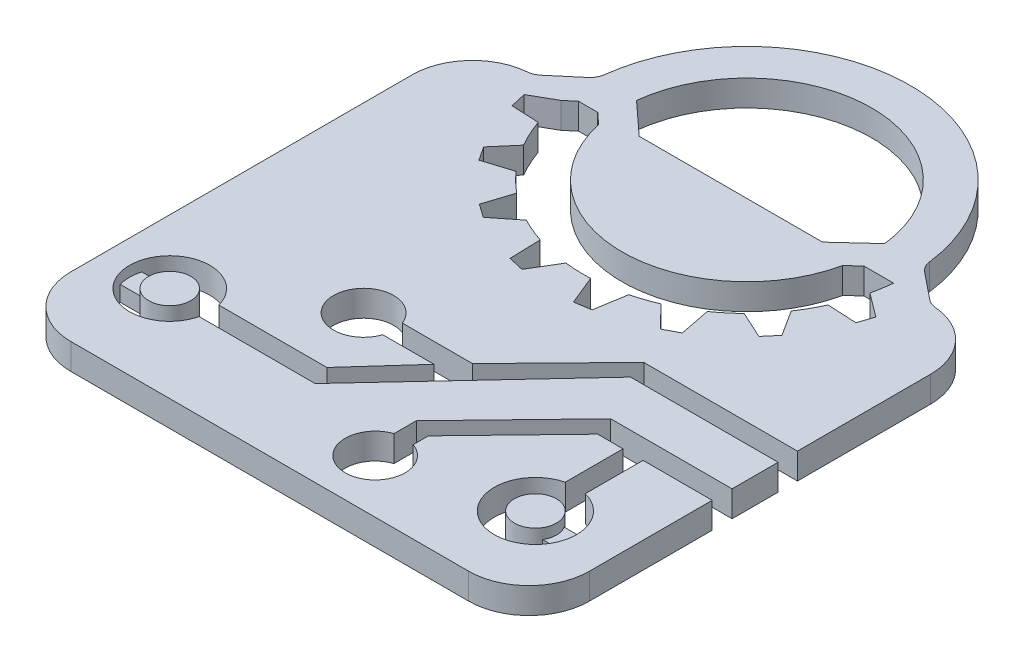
from build123d import *

# Parameters (mm, degrees)
BOSS_EXTRUDE1_DEPTH   = 60.24
SKETCH1_R             = 48.868731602
BOSS_EXTRUDE1_2_DEPTH = 60.24
BOSS_EXTRUDE1_3_DEPTH = 60.24
BOSS_EXTRUDE3_DEPTH   = 36.14
SCALE2_SCALE          = 0.083


with BuildPart() as part:
    # Sketch1 → Boss-Extrude1 (new body)
    with BuildSketch(Plane(origin=(0, 0, 0), x_dir=(1, 0, 0), z_dir=(0, 1, 0))):
        with BuildLine():
            Line((245.136811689, -121.5896186), (601.855675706, -121.5896186))
            Line((601.855675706, -121.5896186), (601.855675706, 187.682234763))
            ThreePointArc((601.855675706, 187.682234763), (564.86409315, 282.493974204), (473.43759091, 327.202338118))
            ThreePointArc((473.43759091, 327.202338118), (461.876494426, 329.931995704), (451.626857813, 335.936571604))
            Line((451.626857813, 335.936571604), (389.269284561, 386.257187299))
            ThreePointArc((389.269284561, 386.257187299), (379.451035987, 397.909466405), (374.702603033, 412.387933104))
            ThreePointArc((374.702603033, 412.387933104), (-2.245902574, 744.620020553), (-378.751905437, 411.886545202))
            ThreePointArc((-378.751905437, 411.886545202), (-383.268389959, 397.789512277), (-392.602428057, 386.300356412))
            Line((-392.602428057, 386.300356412), (-451.452798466, 336.487556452))
            ThreePointArc((-451.452798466, 336.487556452), (-461.934475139, 330.085900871), (-473.864370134, 327.166252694))
            ThreePointArc((-473.864370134, 327.166252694), (-565.00900144, 282.33629643), (-601.855675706, 187.682234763))
            Line((-601.855675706, 187.682234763), (-601.855675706, -604.620104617))
            ThreePointArc((-601.855675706, -604.620104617), (-560.850625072, -703.615053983), (-461.855675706, -744.620104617))
            Line((-461.855675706, -744.620104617), (461.855675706, -744.620104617))
            ThreePointArc((461.855675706, -744.620104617), (560.850625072, -703.615053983), (601.855675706, -604.620104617))
            Line((601.855675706, -604.620104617), (601.855675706, -319.422241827))
            Line((601.855675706, -319.422241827), (441.265840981, -319.422241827))
            Line((441.265840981, -319.422241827), (441.265840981, -453.528275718))
            ThreePointArc((441.265840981, -453.528275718), (418.058525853, -641.476242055), (394.851210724, -453.528275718))
            Line((394.851210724, -453.528275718), (394.851210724, -319.422241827))
            Line((394.851210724, -319.422241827), (335.944215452, -319.422241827))
            Line((335.944215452, -319.422241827), (142.856354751, -519.436956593))
            Line((142.856354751, -519.436956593), (142.856354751, -554.742866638))
            ThreePointArc((142.856354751, -554.742866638), (120.653062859, -690.179705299), (98.449770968, -554.742866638))
            Line((98.449770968, -554.742866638), (98.449770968, -502.873391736))
            Line((98.449770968, -502.873391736), (320.096986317, -273.274781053))
            Line((320.096986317, -273.274781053), (601.855675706, -273.274781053))
            Line((601.855675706, -273.274781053), (601.855675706, -166.507141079))
            Line((601.855675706, -166.507141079), (259.434436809, -166.507141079))
            Line((259.434436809, -166.507141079), (-93.744304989, -545.622056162))
            Line((-93.744304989, -545.622056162), (-362.916340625, -545.622056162))
            ThreePointArc((-362.916340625, -545.622056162), (-546.855622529, -524.023142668), (-363.270093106, -499.599263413))
            Line((-363.270093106, -499.599263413), (-112.399544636, -499.599263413))
            Line((-112.399544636, -499.599263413), (5.361472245, -368.962428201))
            Line((5.361472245, -368.962428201), (-113.501970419, -368.962428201))
            ThreePointArc((-113.501970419, -368.962428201), (-249.518428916, -348.288816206), (-114.325506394, -322.779035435))
            Line((-114.325506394, -322.779035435), (48.642476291, -322.779035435))
            Line((48.642476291, -322.779035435), (245.136811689, -121.5896186))
        make_face()
        with BuildLine():
            Line((-432.04724503, 278.074197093), (-377.53183047, 309.082965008))
            Line((-377.53183047, 309.082965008), (-355.558082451, 327.682234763))
            Line((-355.558082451, 327.682234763), (-311.00487998, 327.682234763))
            Line((-311.00487998, 327.682234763), (-285.170817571, 303.958116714))
            ThreePointArc((-285.170817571, 303.958116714), (-1.993249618, 75.277684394), (281.184318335, 303.958116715))
            Line((281.184318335, 303.958116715), (307.018380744, 327.682234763))
            Line((307.018380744, 327.682234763), (375.844577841, 327.682234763))
            ThreePointArc((375.844577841, 327.682234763), (372.736851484, 303.894991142), (368.133090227, 280.351493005))
            Line((368.133090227, 280.351493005), (423.315621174, 239.086755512))
            Line((423.315621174, 239.086755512), (411.700991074, 204.328702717))
            Line((411.700991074, 204.328702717), (343.629285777, 207.80154068))
            ThreePointArc((343.629285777, 207.80154068), (329.450223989, 179.758582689), (313.000718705, 152.984209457))
            Line((313.000718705, 152.984209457), (351.134848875, 93.057664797))
            Line((351.134848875, 93.057664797), (326.616837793, 64.222608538))
            Line((326.616837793, 64.222608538), (263.258777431, 93.302819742))
            ThreePointArc((263.258777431, 93.302819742), (240.675346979, 72.952010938), (216.536135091, 54.473233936))
            Line((216.536135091, 54.473233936), (230.735666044, -17.751228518))
            Line((230.735666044, -17.751228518), (197.60701684, -35.273260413))
            Line((197.60701684, -35.273260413), (147.505463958, 15.949807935))
            ThreePointArc((147.505463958, 15.949807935), (119.950842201, 5.39379962), (91.659661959, -2.990448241))
            Line((91.659661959, -2.990448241), (79.663676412, -75.909277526))
            Line((79.663676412, -75.909277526), (42.300731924, -81.903656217))
            Line((42.300731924, -81.903656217), (14.582800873, -14.360296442))
            ThreePointArc((14.582800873, -14.360296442), (-15.275317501, -14.489920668), (-45.051290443, -12.272834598))
            Line((-45.051290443, -12.272834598), (-83.280168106, -75.909277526))
            Line((-83.280168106, -75.909277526), (-119.154621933, -67.827972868))
            Line((-119.154621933, -67.827972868), (-121.342158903, 4.524054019))
            ThreePointArc((-121.342158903, 4.524054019), (-149.646358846, 15.164979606), (-177.013982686, 28.024614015))
            Line((-177.013982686, 28.024614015), (-232.837233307, -16.202636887))
            Line((-232.837233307, -16.202636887), (-263.791383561, 5.63329143))
            Line((-263.791383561, 5.63329143), (-242.544154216, 71.204975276))
            ThreePointArc((-242.544154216, 71.204975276), (-265.738147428, 91.839288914), (-287.168837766, 114.299514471))
            Line((-287.168837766, 114.299514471), (-352.738766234, 93.62948679))
            Line((-352.738766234, 93.62948679), (-373.882163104, 125.736780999))
            Line((-373.882163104, 125.736780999), (-331.142798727, 175.711471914))
            ThreePointArc((-331.142798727, 175.711471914), (-346.995362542, 206.44410005), (-359.985961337, 238.491604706))
            Line((-359.985961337, 238.491604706), (-423.751835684, 241.39005354))
            Line((-423.751835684, 241.39005354), (-432.04724503, 278.074197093))
        make_face(mode=Mode.SUBTRACT)
        with BuildLine():
            Line((-214.783328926, 327.682234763), (-289.920929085, 396.683124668))
            ThreePointArc((-289.920929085, 396.683124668), (-1.993249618, 654.620104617), (285.934429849, 396.683124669))
            Line((285.934429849, 396.683124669), (210.79682969, 327.682234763))
            Line((210.79682969, 327.682234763), (-214.783328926, 327.682234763))
        make_face(mode=Mode.SUBTRACT)
    extrude(amount=BOSS_EXTRUDE1_DEPTH)



with BuildPart() as body_2:
    # Sketch1 → Boss-Extrude1 2 (new body)
    with BuildSketch(Plane(origin=(0, 0, 0), x_dir=(1, 0, 0), z_dir=(0, 1, 0))):
        with Locations(Location((-453.53363435, -523.305826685, 0), (0, 0, 270))):
            Circle(SKETCH1_R)
    extrude(amount=BOSS_EXTRUDE1_2_DEPTH)


with BuildPart() as body_3:
    # Sketch1 → Boss-Extrude1 3 (new body)
    with BuildSketch(Plane(origin=(0, 0, 0), x_dir=(1, 0, 0), z_dir=(0, 1, 0))):
        with Locations(Location((418.058525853, -546.069470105, 0), (0, 0, 270))):
            Circle(SKETCH1_R)
    extrude(amount=BOSS_EXTRUDE1_3_DEPTH)


with BuildPart() as part_1:
    add(part.part)

    add(body_2.part)  # Boss-Extrude3 merges body 2

    add(body_3.part)  # Boss-Extrude3 merges body 3
    # Sketch1_4 → Boss-Extrude3 (add)
    with BuildSketch(Plane(origin=(0, 0, 0), x_dir=(1, 0, 0), z_dir=(0, 1, 0))):
        with BuildLine():
            ThreePointArc((-543.447526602, -498.305826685), (-546.8583793, -523.305826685), (-543.447526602, -548.305826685))
            Line((-543.447526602, -548.305826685), (-495.523548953, -548.305826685))
            ThreePointArc((-495.523548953, -548.305826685), (-502.402365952, -523.305826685), (-495.523548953, -498.305826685))
            Line((-495.523548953, -498.305826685), (-543.447526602, -498.305826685))
        make_face()
        with BuildLine():
            ThreePointArc((510.131606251, -571.069470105), (513.465297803, -546.069470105), (510.131606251, -521.069470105))
            Line((510.131606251, -521.069470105), (460.048440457, -521.069470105))
            ThreePointArc((460.048440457, -521.069470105), (465.176180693, -533.104921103), (466.927257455, -546.069470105))
            ThreePointArc((466.927257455, -546.069470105), (465.176180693, -559.034019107), (460.048440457, -571.069470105))
            Line((460.048440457, -571.069470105), (510.131606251, -571.069470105))
        make_face()
    extrude(amount=BOSS_EXTRUDE3_DEPTH)


with BuildPart() as part_2:
    # Scale2: scaled about (-14.211869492, 30.089630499, 137.50454529)
    add(part_1.part.scale(SCALE2_SCALE).moved(Location((-13.032284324, 27.592191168, 126.091668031))))


solid = part_2.part
